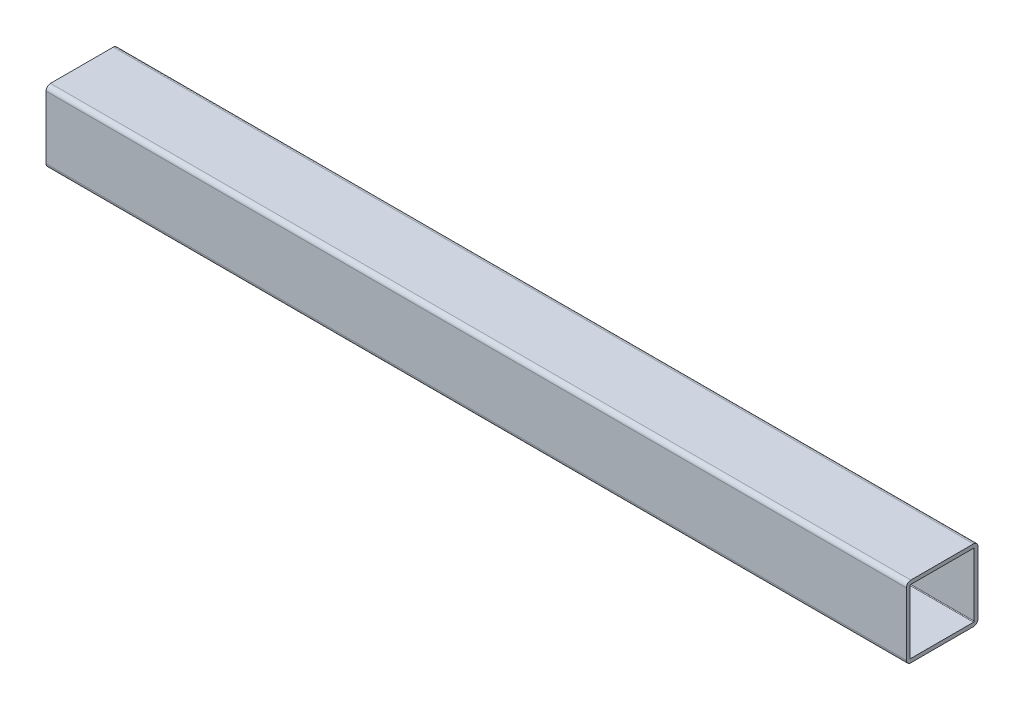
from build123d import *

# Parameters (mm, degrees)
EXTRUDE1_DEPTH = 304.8


with BuildPart() as part:
    # Sketch1 → Extrude1 (new body)
    with BuildSketch(Plane(origin=(0, 0, 0), x_dir=(0, 0, -1), z_dir=(1, 0, 0))):
        with BuildLine():
            Line((-5.373037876, 5.244240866), (16.851962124, 5.244240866))
            ThreePointArc((16.851962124, 5.244240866), (17.974494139, 4.779272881), (18.439462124, 3.656740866))
            Line((18.439462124, 3.656740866), (18.439462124, -18.568259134))
            ThreePointArc((18.439462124, -18.568259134), (17.974494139, -19.690791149), (16.851962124, -20.155759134))
            Line((16.851962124, -20.155759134), (-5.373037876, -20.155759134))
            ThreePointArc((-5.373037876, -20.155759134), (-6.495569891, -19.690791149), (-6.960537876, -18.568259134))
            Line((-6.960537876, -18.568259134), (-6.960537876, 3.656740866))
            ThreePointArc((-6.960537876, 3.656740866), (-6.495569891, 4.779272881), (-5.373037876, 5.244240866))
        make_face()
        with BuildLine():
            Line((-5.373037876, 3.898040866), (16.851962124, 3.898040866))
            ThreePointArc((16.851962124, 3.898040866), (17.02258699, 3.827365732), (17.093262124, 3.656740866))
            Line((17.093262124, 3.656740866), (17.093262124, -18.568259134))
            ThreePointArc((17.093262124, -18.568259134), (17.02258699, -18.738884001), (16.851962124, -18.809559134))
            Line((16.851962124, -18.809559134), (-5.373037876, -18.809559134))
            ThreePointArc((-5.373037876, -18.809559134), (-5.543662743, -18.738884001), (-5.614337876, -18.568259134))
            Line((-5.614337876, -18.568259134), (-5.614337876, 3.656740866))
            ThreePointArc((-5.614337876, 3.656740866), (-5.543662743, 3.827365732), (-5.373037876, 3.898040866))
        make_face(mode=Mode.SUBTRACT)
    extrude(amount=EXTRUDE1_DEPTH)


solid = part.part
